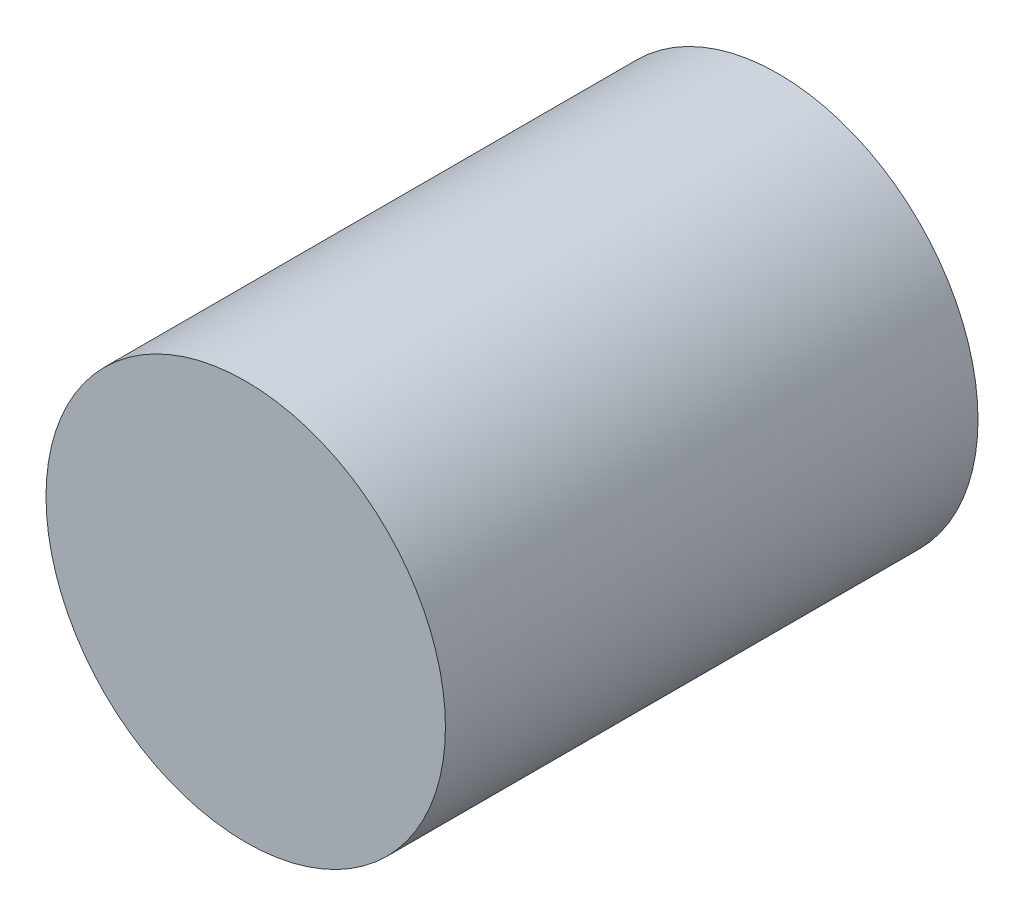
ISO-10303-21;
HEADER;
FILE_DESCRIPTION(('STEP AP214'),'2;1');
FILE_NAME('part.step','',(''),(''),'','','');
FILE_SCHEMA(('AUTOMOTIVE_DESIGN { 1 0 10303 214 1 1 1 1 }'));
ENDSEC;
DATA;
#1=APPLICATION_CONTEXT('core data for automotive mechanical design processes');
#2=APPLICATION_PROTOCOL_DEFINITION('international standard','automotive_design',2000,#1);
#3=PRODUCT_CONTEXT('',#1,'mechanical');
#4=PRODUCT('Part','Part','',(#3));
#5=PRODUCT_RELATED_PRODUCT_CATEGORY('part','',(#4));
#6=PRODUCT_DEFINITION_FORMATION('','',#4);
#7=PRODUCT_DEFINITION_CONTEXT('part definition',#1,'design');
#8=PRODUCT_DEFINITION('design','',#6,#7);
#9=PRODUCT_DEFINITION_SHAPE('','',#8);
#10=(LENGTH_UNIT() NAMED_UNIT(*) SI_UNIT(.MILLI.,.METRE.));
#11=(NAMED_UNIT(*) PLANE_ANGLE_UNIT() SI_UNIT($,.RADIAN.));
#12=(NAMED_UNIT(*) SI_UNIT($,.STERADIAN.) SOLID_ANGLE_UNIT());
#13=UNCERTAINTY_MEASURE_WITH_UNIT(LENGTH_MEASURE(1.E-05),#10,'distance_accuracy_value','');
#14=(GEOMETRIC_REPRESENTATION_CONTEXT(3) GLOBAL_UNCERTAINTY_ASSIGNED_CONTEXT((#13)) GLOBAL_UNIT_ASSIGNED_CONTEXT((#10,
#11,#12)) REPRESENTATION_CONTEXT('',''));
#15=CARTESIAN_POINT('',(0.,0.,0.));
#16=DIRECTION('',(0.,0.,1.));
#17=DIRECTION('',(1.,0.,0.));
#18=AXIS2_PLACEMENT_3D('',#15,#16,#17);
#19=CARTESIAN_POINT('',(0.,0.,4.));
#20=DIRECTION('',(0.,0.,1.));
#21=DIRECTION('',(1.,0.,0.));
#22=AXIS2_PLACEMENT_3D('',#19,#20,#21);
#23=PLANE('',#22);
#24=CARTESIAN_POINT('',(0.,0.,4.));
#25=DIRECTION('',(0.,0.,-1.));
#26=DIRECTION('',(-1.,0.,0.));
#27=AXIS2_PLACEMENT_3D('',#24,#25,#26);
#28=CIRCLE('',#27,3.);
#29=CARTESIAN_POINT('',(-3.,0.,4.));
#30=VERTEX_POINT('',#29);
#31=EDGE_CURVE('E10',#30,#30,#28,.T.);
#32=ORIENTED_EDGE('',*,*,#31,.F.);
#33=EDGE_LOOP('',(#32));
#34=FACE_BOUND('',#33,.T.);
#35=ADVANCED_FACE('F15',(#34),#23,.T.);
#36=CARTESIAN_POINT('',(0.,0.,-4.));
#37=DIRECTION('',(0.,0.,-1.));
#38=DIRECTION('',(-1.,0.,0.));
#39=AXIS2_PLACEMENT_3D('',#36,#37,#38);
#40=PLANE('',#39);
#41=CARTESIAN_POINT('',(0.,0.,-4.));
#42=DIRECTION('',(0.,0.,1.));
#43=DIRECTION('',(1.,0.,0.));
#44=AXIS2_PLACEMENT_3D('',#41,#42,#43);
#45=CIRCLE('',#44,3.);
#46=CARTESIAN_POINT('',(3.,0.,-4.));
#47=VERTEX_POINT('',#46);
#48=EDGE_CURVE('E22',#47,#47,#45,.T.);
#49=ORIENTED_EDGE('',*,*,#48,.F.);
#50=EDGE_LOOP('',(#49));
#51=FACE_BOUND('',#50,.T.);
#52=ADVANCED_FACE('F26',(#51),#40,.T.);
#53=CARTESIAN_POINT('',(0.,0.,-4.));
#54=DIRECTION('',(0.,0.,1.));
#55=DIRECTION('',(1.,0.,0.));
#56=AXIS2_PLACEMENT_3D('',#53,#54,#55);
#57=CYLINDRICAL_SURFACE('',#56,3.);
#58=ORIENTED_EDGE('',*,*,#31,.T.);
#59=EDGE_LOOP('',(#58));
#60=FACE_BOUND('',#59,.T.);
#61=ORIENTED_EDGE('',*,*,#48,.T.);
#62=EDGE_LOOP('',(#61));
#63=FACE_BOUND('',#62,.T.);
#64=ADVANCED_FACE('F17',(#60,#63),#57,.T.);
#65=CLOSED_SHELL('',(#35,#52,#64));
#66=MANIFOLD_SOLID_BREP('B1',#65);
#67=ADVANCED_BREP_SHAPE_REPRESENTATION('',(#18,#66),#14);
#68=SHAPE_DEFINITION_REPRESENTATION(#9,#67);
ENDSEC;
END-ISO-10303-21;
